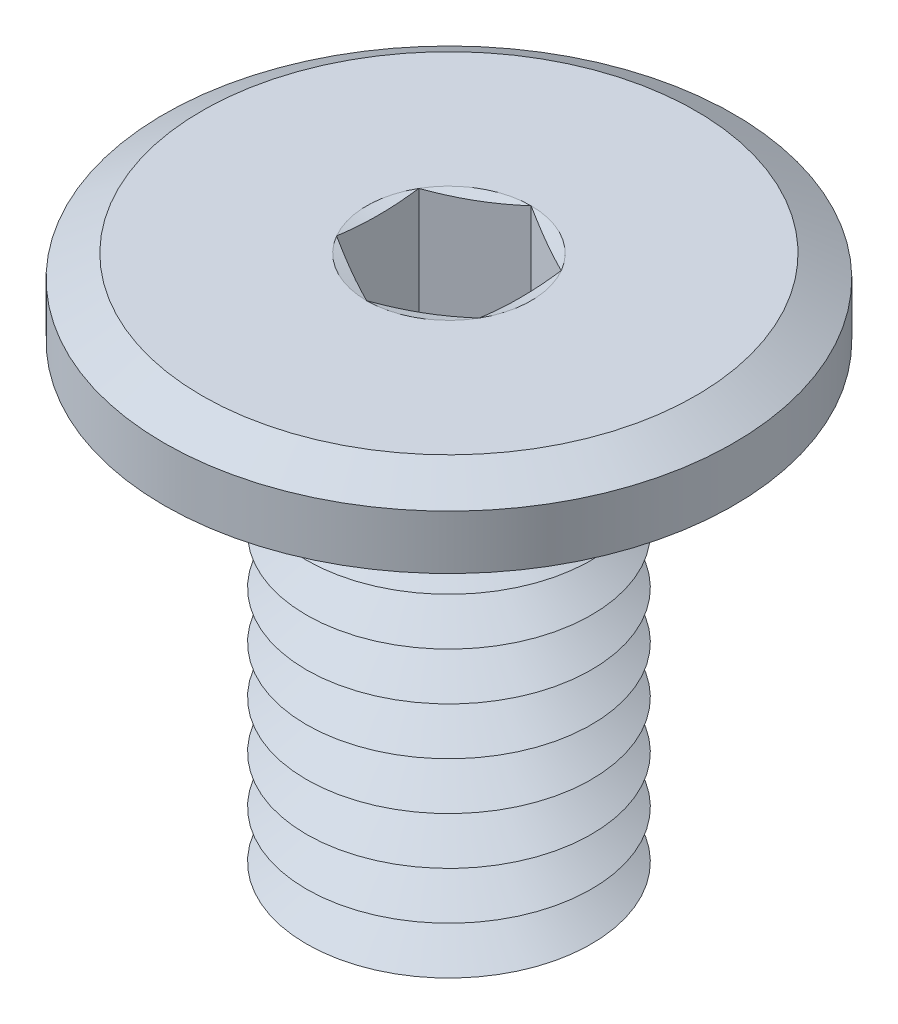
ISO-10303-21;
HEADER;
FILE_DESCRIPTION(('STEP AP214'),'2;1');
FILE_NAME('part.step','',(''),(''),'','','');
FILE_SCHEMA(('AUTOMOTIVE_DESIGN { 1 0 10303 214 1 1 1 1 }'));
ENDSEC;
DATA;
#1=APPLICATION_CONTEXT('core data for automotive mechanical design processes');
#2=APPLICATION_PROTOCOL_DEFINITION('international standard','automotive_design',2000,#1);
#3=PRODUCT_CONTEXT('',#1,'mechanical');
#4=PRODUCT('Part','Part','',(#3));
#5=PRODUCT_RELATED_PRODUCT_CATEGORY('part','',(#4));
#6=PRODUCT_DEFINITION_FORMATION('','',#4);
#7=PRODUCT_DEFINITION_CONTEXT('part definition',#1,'design');
#8=PRODUCT_DEFINITION('design','',#6,#7);
#9=PRODUCT_DEFINITION_SHAPE('','',#8);
#10=(LENGTH_UNIT() NAMED_UNIT(*) SI_UNIT(.MILLI.,.METRE.));
#11=(NAMED_UNIT(*) PLANE_ANGLE_UNIT() SI_UNIT($,.RADIAN.));
#12=(NAMED_UNIT(*) SI_UNIT($,.STERADIAN.) SOLID_ANGLE_UNIT());
#13=UNCERTAINTY_MEASURE_WITH_UNIT(LENGTH_MEASURE(1.E-05),#10,'distance_accuracy_value','');
#14=(GEOMETRIC_REPRESENTATION_CONTEXT(3) GLOBAL_UNCERTAINTY_ASSIGNED_CONTEXT((#13)) GLOBAL_UNIT_ASSIGNED_CONTEXT((#10,
#11,#12)) REPRESENTATION_CONTEXT('',''));
#15=CARTESIAN_POINT('',(0.,0.,0.));
#16=DIRECTION('',(0.,0.,1.));
#17=DIRECTION('',(1.,0.,0.));
#18=AXIS2_PLACEMENT_3D('',#15,#16,#17);
#19=CARTESIAN_POINT('',(0.,-5.05,0.));
#20=DIRECTION('',(0.,-1.,0.));
#21=DIRECTION('',(0.,0.,-1.));
#22=AXIS2_PLACEMENT_3D('',#19,#20,#21);
#23=CONICAL_SURFACE('',#22,1.5,1.0471975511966);
#24=CARTESIAN_POINT('',(0.,-4.8,0.));
#25=DIRECTION('',(0.,1.,0.));
#26=DIRECTION('',(0.,0.,1.));
#27=AXIS2_PLACEMENT_3D('',#24,#25,#26);
#28=CIRCLE('',#27,1.06698729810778);
#29=CARTESIAN_POINT('',(0.,-4.8,1.06698729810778));
#30=VERTEX_POINT('',#29);
#31=EDGE_CURVE('E428',#30,#30,#28,.T.);
#32=ORIENTED_EDGE('',*,*,#31,.F.);
#33=EDGE_LOOP('',(#32));
#34=FACE_BOUND('',#33,.T.);
#35=CARTESIAN_POINT('',(0.,-5.05,0.));
#36=DIRECTION('',(0.,1.,0.));
#37=DIRECTION('',(0.,0.,1.));
#38=AXIS2_PLACEMENT_3D('',#35,#36,#37);
#39=CIRCLE('',#38,1.5);
#40=CARTESIAN_POINT('',(0.,-5.05,1.5));
#41=VERTEX_POINT('',#40);
#42=EDGE_CURVE('E431',#41,#41,#39,.T.);
#43=ORIENTED_EDGE('',*,*,#42,.T.);
#44=EDGE_LOOP('',(#43));
#45=FACE_BOUND('',#44,.T.);
#46=ADVANCED_FACE('F39',(#34,#45),#23,.T.);
#47=CARTESIAN_POINT('',(0.,-4.8,0.));
#48=DIRECTION('',(0.,1.,0.));
#49=DIRECTION('',(0.,0.,1.));
#50=AXIS2_PLACEMENT_3D('',#47,#48,#49);
#51=CONICAL_SURFACE('',#50,1.06698729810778,1.0471975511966);
#52=CARTESIAN_POINT('',(0.,-4.55,0.));
#53=DIRECTION('',(0.,1.,0.));
#54=DIRECTION('',(0.,0.,1.));
#55=AXIS2_PLACEMENT_3D('',#52,#53,#54);
#56=CIRCLE('',#55,1.5);
#57=CARTESIAN_POINT('',(0.,-4.55,1.5));
#58=VERTEX_POINT('',#57);
#59=EDGE_CURVE('E424',#58,#58,#56,.T.);
#60=ORIENTED_EDGE('',*,*,#59,.F.);
#61=EDGE_LOOP('',(#60));
#62=FACE_BOUND('',#61,.T.);
#63=ORIENTED_EDGE('',*,*,#31,.T.);
#64=EDGE_LOOP('',(#63));
#65=FACE_BOUND('',#64,.T.);
#66=ADVANCED_FACE('F233',(#62,#65),#51,.T.);
#67=CARTESIAN_POINT('',(0.,-5.8,0.));
#68=DIRECTION('',(0.,-1.,0.));
#69=DIRECTION('',(0.,0.,-1.));
#70=AXIS2_PLACEMENT_3D('',#67,#68,#69);
#71=PLANE('',#70);
#72=CARTESIAN_POINT('',(0.,-5.8,0.));
#73=DIRECTION('',(0.,1.,0.));
#74=DIRECTION('',(0.,0.,1.));
#75=AXIS2_PLACEMENT_3D('',#72,#73,#74);
#76=CIRCLE('',#75,1.06698729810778);
#77=CARTESIAN_POINT('',(0.,-5.8,1.06698729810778));
#78=VERTEX_POINT('',#77);
#79=EDGE_CURVE('E300',#78,#78,#76,.T.);
#80=ORIENTED_EDGE('',*,*,#79,.F.);
#81=EDGE_LOOP('',(#80));
#82=FACE_BOUND('',#81,.T.);
#83=ADVANCED_FACE('F239',(#82),#71,.T.);
#84=CARTESIAN_POINT('',(0.,-5.8,0.));
#85=DIRECTION('',(0.,1.,0.));
#86=DIRECTION('',(0.,0.,1.));
#87=AXIS2_PLACEMENT_3D('',#84,#85,#86);
#88=CONICAL_SURFACE('',#87,1.06698729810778,1.0471975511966);
#89=CARTESIAN_POINT('',(0.,-5.55,0.));
#90=DIRECTION('',(0.,1.,0.));
#91=DIRECTION('',(0.,0.,1.));
#92=AXIS2_PLACEMENT_3D('',#89,#90,#91);
#93=CIRCLE('',#92,1.5);
#94=CARTESIAN_POINT('',(0.,-5.55,1.5));
#95=VERTEX_POINT('',#94);
#96=EDGE_CURVE('E437',#95,#95,#93,.T.);
#97=ORIENTED_EDGE('',*,*,#96,.F.);
#98=EDGE_LOOP('',(#97));
#99=FACE_BOUND('',#98,.T.);
#100=ORIENTED_EDGE('',*,*,#79,.T.);
#101=EDGE_LOOP('',(#100));
#102=FACE_BOUND('',#101,.T.);
#103=ADVANCED_FACE('F254',(#99,#102),#88,.T.);
#104=CARTESIAN_POINT('',(0.,-5.55,0.));
#105=DIRECTION('',(0.,-1.,0.));
#106=DIRECTION('',(0.,0.,-1.));
#107=AXIS2_PLACEMENT_3D('',#104,#105,#106);
#108=CONICAL_SURFACE('',#107,1.5,1.0471975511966);
#109=CARTESIAN_POINT('',(0.,-5.3,0.));
#110=DIRECTION('',(0.,1.,0.));
#111=DIRECTION('',(0.,0.,1.));
#112=AXIS2_PLACEMENT_3D('',#109,#110,#111);
#113=CIRCLE('',#112,1.06698729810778);
#114=CARTESIAN_POINT('',(0.,-5.3,1.06698729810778));
#115=VERTEX_POINT('',#114);
#116=EDGE_CURVE('E434',#115,#115,#113,.T.);
#117=ORIENTED_EDGE('',*,*,#116,.F.);
#118=EDGE_LOOP('',(#117));
#119=FACE_BOUND('',#118,.T.);
#120=ORIENTED_EDGE('',*,*,#96,.T.);
#121=EDGE_LOOP('',(#120));
#122=FACE_BOUND('',#121,.T.);
#123=ADVANCED_FACE('F250',(#119,#122),#108,.T.);
#124=CARTESIAN_POINT('',(0.,-5.3,0.));
#125=DIRECTION('',(0.,1.,0.));
#126=DIRECTION('',(0.,0.,1.));
#127=AXIS2_PLACEMENT_3D('',#124,#125,#126);
#128=CONICAL_SURFACE('',#127,1.06698729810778,1.0471975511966);
#129=ORIENTED_EDGE('',*,*,#42,.F.);
#130=EDGE_LOOP('',(#129));
#131=FACE_BOUND('',#130,.T.);
#132=ORIENTED_EDGE('',*,*,#116,.T.);
#133=EDGE_LOOP('',(#132));
#134=FACE_BOUND('',#133,.T.);
#135=ADVANCED_FACE('F246',(#131,#134),#128,.T.);
#136=CARTESIAN_POINT('',(0.,-4.55,0.));
#137=DIRECTION('',(0.,-1.,0.));
#138=DIRECTION('',(0.,0.,-1.));
#139=AXIS2_PLACEMENT_3D('',#136,#137,#138);
#140=CONICAL_SURFACE('',#139,1.5,1.0471975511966);
#141=CARTESIAN_POINT('',(0.,-4.3,0.));
#142=DIRECTION('',(0.,1.,0.));
#143=DIRECTION('',(0.,0.,1.));
#144=AXIS2_PLACEMENT_3D('',#141,#142,#143);
#145=CIRCLE('',#144,1.06698729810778);
#146=CARTESIAN_POINT('',(0.,-4.3,1.06698729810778));
#147=VERTEX_POINT('',#146);
#148=EDGE_CURVE('E420',#147,#147,#145,.T.);
#149=ORIENTED_EDGE('',*,*,#148,.F.);
#150=EDGE_LOOP('',(#149));
#151=FACE_BOUND('',#150,.T.);
#152=ORIENTED_EDGE('',*,*,#59,.T.);
#153=EDGE_LOOP('',(#152));
#154=FACE_BOUND('',#153,.T.);
#155=ADVANCED_FACE('F249',(#151,#154),#140,.T.);
#156=CARTESIAN_POINT('',(0.,-4.3,0.));
#157=DIRECTION('',(0.,1.,0.));
#158=DIRECTION('',(0.,0.,1.));
#159=AXIS2_PLACEMENT_3D('',#156,#157,#158);
#160=CONICAL_SURFACE('',#159,1.06698729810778,1.0471975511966);
#161=CARTESIAN_POINT('',(0.,-4.05,0.));
#162=DIRECTION('',(0.,1.,0.));
#163=DIRECTION('',(0.,0.,1.));
#164=AXIS2_PLACEMENT_3D('',#161,#162,#163);
#165=CIRCLE('',#164,1.5);
#166=CARTESIAN_POINT('',(0.,-4.05,1.5));
#167=VERTEX_POINT('',#166);
#168=EDGE_CURVE('E416',#167,#167,#165,.T.);
#169=ORIENTED_EDGE('',*,*,#168,.F.);
#170=EDGE_LOOP('',(#169));
#171=FACE_BOUND('',#170,.T.);
#172=ORIENTED_EDGE('',*,*,#148,.T.);
#173=EDGE_LOOP('',(#172));
#174=FACE_BOUND('',#173,.T.);
#175=ADVANCED_FACE('F536',(#171,#174),#160,.T.);
#176=CARTESIAN_POINT('',(0.,-4.05,0.));
#177=DIRECTION('',(0.,-1.,0.));
#178=DIRECTION('',(0.,0.,-1.));
#179=AXIS2_PLACEMENT_3D('',#176,#177,#178);
#180=CONICAL_SURFACE('',#179,1.5,1.0471975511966);
#181=CARTESIAN_POINT('',(0.,-3.8,0.));
#182=DIRECTION('',(0.,1.,0.));
#183=DIRECTION('',(0.,0.,1.));
#184=AXIS2_PLACEMENT_3D('',#181,#182,#183);
#185=CIRCLE('',#184,1.06698729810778);
#186=CARTESIAN_POINT('',(0.,-3.8,1.06698729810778));
#187=VERTEX_POINT('',#186);
#188=EDGE_CURVE('E413',#187,#187,#185,.T.);
#189=ORIENTED_EDGE('',*,*,#188,.F.);
#190=EDGE_LOOP('',(#189));
#191=FACE_BOUND('',#190,.T.);
#192=ORIENTED_EDGE('',*,*,#168,.T.);
#193=EDGE_LOOP('',(#192));
#194=FACE_BOUND('',#193,.T.);
#195=ADVANCED_FACE('F532',(#191,#194),#180,.T.);
#196=CARTESIAN_POINT('',(0.,-3.8,0.));
#197=DIRECTION('',(0.,1.,0.));
#198=DIRECTION('',(0.,0.,1.));
#199=AXIS2_PLACEMENT_3D('',#196,#197,#198);
#200=CONICAL_SURFACE('',#199,1.06698729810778,1.0471975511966);
#201=CARTESIAN_POINT('',(0.,-3.55,0.));
#202=DIRECTION('',(0.,1.,0.));
#203=DIRECTION('',(0.,0.,1.));
#204=AXIS2_PLACEMENT_3D('',#201,#202,#203);
#205=CIRCLE('',#204,1.5);
#206=CARTESIAN_POINT('',(0.,-3.55,1.5));
#207=VERTEX_POINT('',#206);
#208=EDGE_CURVE('E409',#207,#207,#205,.T.);
#209=ORIENTED_EDGE('',*,*,#208,.F.);
#210=EDGE_LOOP('',(#209));
#211=FACE_BOUND('',#210,.T.);
#212=ORIENTED_EDGE('',*,*,#188,.T.);
#213=EDGE_LOOP('',(#212));
#214=FACE_BOUND('',#213,.T.);
#215=ADVANCED_FACE('F528',(#211,#214),#200,.T.);
#216=CARTESIAN_POINT('',(0.,-3.55,0.));
#217=DIRECTION('',(0.,-1.,0.));
#218=DIRECTION('',(0.,0.,-1.));
#219=AXIS2_PLACEMENT_3D('',#216,#217,#218);
#220=CONICAL_SURFACE('',#219,1.5,1.0471975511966);
#221=CARTESIAN_POINT('',(0.,-3.3,0.));
#222=DIRECTION('',(0.,1.,0.));
#223=DIRECTION('',(0.,0.,1.));
#224=AXIS2_PLACEMENT_3D('',#221,#222,#223);
#225=CIRCLE('',#224,1.06698729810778);
#226=CARTESIAN_POINT('',(0.,-3.3,1.06698729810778));
#227=VERTEX_POINT('',#226);
#228=EDGE_CURVE('E405',#227,#227,#225,.T.);
#229=ORIENTED_EDGE('',*,*,#228,.F.);
#230=EDGE_LOOP('',(#229));
#231=FACE_BOUND('',#230,.T.);
#232=ORIENTED_EDGE('',*,*,#208,.T.);
#233=EDGE_LOOP('',(#232));
#234=FACE_BOUND('',#233,.T.);
#235=ADVANCED_FACE('F524',(#231,#234),#220,.T.);
#236=CARTESIAN_POINT('',(0.,-3.3,0.));
#237=DIRECTION('',(0.,1.,0.));
#238=DIRECTION('',(0.,0.,1.));
#239=AXIS2_PLACEMENT_3D('',#236,#237,#238);
#240=CONICAL_SURFACE('',#239,1.06698729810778,1.0471975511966);
#241=CARTESIAN_POINT('',(0.,-3.05,0.));
#242=DIRECTION('',(0.,1.,0.));
#243=DIRECTION('',(0.,0.,1.));
#244=AXIS2_PLACEMENT_3D('',#241,#242,#243);
#245=CIRCLE('',#244,1.5);
#246=CARTESIAN_POINT('',(0.,-3.05,1.5));
#247=VERTEX_POINT('',#246);
#248=EDGE_CURVE('E401',#247,#247,#245,.T.);
#249=ORIENTED_EDGE('',*,*,#248,.F.);
#250=EDGE_LOOP('',(#249));
#251=FACE_BOUND('',#250,.T.);
#252=ORIENTED_EDGE('',*,*,#228,.T.);
#253=EDGE_LOOP('',(#252));
#254=FACE_BOUND('',#253,.T.);
#255=ADVANCED_FACE('F520',(#251,#254),#240,.T.);
#256=CARTESIAN_POINT('',(0.,-3.05,0.));
#257=DIRECTION('',(0.,-1.,0.));
#258=DIRECTION('',(0.,0.,-1.));
#259=AXIS2_PLACEMENT_3D('',#256,#257,#258);
#260=CONICAL_SURFACE('',#259,1.5,1.0471975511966);
#261=CARTESIAN_POINT('',(0.,-2.8,0.));
#262=DIRECTION('',(0.,1.,0.));
#263=DIRECTION('',(0.,0.,1.));
#264=AXIS2_PLACEMENT_3D('',#261,#262,#263);
#265=CIRCLE('',#264,1.06698729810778);
#266=CARTESIAN_POINT('',(0.,-2.8,1.06698729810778));
#267=VERTEX_POINT('',#266);
#268=EDGE_CURVE('E397',#267,#267,#265,.T.);
#269=ORIENTED_EDGE('',*,*,#268,.F.);
#270=EDGE_LOOP('',(#269));
#271=FACE_BOUND('',#270,.T.);
#272=ORIENTED_EDGE('',*,*,#248,.T.);
#273=EDGE_LOOP('',(#272));
#274=FACE_BOUND('',#273,.T.);
#275=ADVANCED_FACE('F516',(#271,#274),#260,.T.);
#276=CARTESIAN_POINT('',(0.,-2.8,0.));
#277=DIRECTION('',(0.,1.,0.));
#278=DIRECTION('',(0.,0.,1.));
#279=AXIS2_PLACEMENT_3D('',#276,#277,#278);
#280=CONICAL_SURFACE('',#279,1.06698729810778,1.0471975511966);
#281=CARTESIAN_POINT('',(0.,-2.55,0.));
#282=DIRECTION('',(0.,1.,0.));
#283=DIRECTION('',(0.,0.,1.));
#284=AXIS2_PLACEMENT_3D('',#281,#282,#283);
#285=CIRCLE('',#284,1.5);
#286=CARTESIAN_POINT('',(0.,-2.55,1.5));
#287=VERTEX_POINT('',#286);
#288=EDGE_CURVE('E393',#287,#287,#285,.T.);
#289=ORIENTED_EDGE('',*,*,#288,.F.);
#290=EDGE_LOOP('',(#289));
#291=FACE_BOUND('',#290,.T.);
#292=ORIENTED_EDGE('',*,*,#268,.T.);
#293=EDGE_LOOP('',(#292));
#294=FACE_BOUND('',#293,.T.);
#295=ADVANCED_FACE('F512',(#291,#294),#280,.T.);
#296=CARTESIAN_POINT('',(0.,-2.55,0.));
#297=DIRECTION('',(0.,-1.,0.));
#298=DIRECTION('',(0.,0.,-1.));
#299=AXIS2_PLACEMENT_3D('',#296,#297,#298);
#300=CONICAL_SURFACE('',#299,1.5,1.0471975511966);
#301=CARTESIAN_POINT('',(0.,-2.3,0.));
#302=DIRECTION('',(0.,1.,0.));
#303=DIRECTION('',(0.,0.,1.));
#304=AXIS2_PLACEMENT_3D('',#301,#302,#303);
#305=CIRCLE('',#304,1.06698729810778);
#306=CARTESIAN_POINT('',(0.,-2.3,1.06698729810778));
#307=VERTEX_POINT('',#306);
#308=EDGE_CURVE('E389',#307,#307,#305,.T.);
#309=ORIENTED_EDGE('',*,*,#308,.F.);
#310=EDGE_LOOP('',(#309));
#311=FACE_BOUND('',#310,.T.);
#312=ORIENTED_EDGE('',*,*,#288,.T.);
#313=EDGE_LOOP('',(#312));
#314=FACE_BOUND('',#313,.T.);
#315=ADVANCED_FACE('F508',(#311,#314),#300,.T.);
#316=CARTESIAN_POINT('',(0.,-2.3,0.));
#317=DIRECTION('',(0.,1.,0.));
#318=DIRECTION('',(0.,0.,1.));
#319=AXIS2_PLACEMENT_3D('',#316,#317,#318);
#320=CONICAL_SURFACE('',#319,1.06698729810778,1.0471975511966);
#321=CARTESIAN_POINT('',(0.,-2.05,0.));
#322=DIRECTION('',(0.,1.,0.));
#323=DIRECTION('',(0.,0.,1.));
#324=AXIS2_PLACEMENT_3D('',#321,#322,#323);
#325=CIRCLE('',#324,1.5);
#326=CARTESIAN_POINT('',(0.,-2.05,1.5));
#327=VERTEX_POINT('',#326);
#328=EDGE_CURVE('E385',#327,#327,#325,.T.);
#329=ORIENTED_EDGE('',*,*,#328,.F.);
#330=EDGE_LOOP('',(#329));
#331=FACE_BOUND('',#330,.T.);
#332=ORIENTED_EDGE('',*,*,#308,.T.);
#333=EDGE_LOOP('',(#332));
#334=FACE_BOUND('',#333,.T.);
#335=ADVANCED_FACE('F504',(#331,#334),#320,.T.);
#336=CARTESIAN_POINT('',(0.,-2.05,0.));
#337=DIRECTION('',(0.,-1.,0.));
#338=DIRECTION('',(0.,0.,-1.));
#339=AXIS2_PLACEMENT_3D('',#336,#337,#338);
#340=CONICAL_SURFACE('',#339,1.5,1.0471975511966);
#341=CARTESIAN_POINT('',(0.,-1.8,0.));
#342=DIRECTION('',(0.,1.,0.));
#343=DIRECTION('',(0.,0.,1.));
#344=AXIS2_PLACEMENT_3D('',#341,#342,#343);
#345=CIRCLE('',#344,1.06698729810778);
#346=CARTESIAN_POINT('',(0.,-1.8,1.06698729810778));
#347=VERTEX_POINT('',#346);
#348=EDGE_CURVE('E381',#347,#347,#345,.T.);
#349=ORIENTED_EDGE('',*,*,#348,.F.);
#350=EDGE_LOOP('',(#349));
#351=FACE_BOUND('',#350,.T.);
#352=ORIENTED_EDGE('',*,*,#328,.T.);
#353=EDGE_LOOP('',(#352));
#354=FACE_BOUND('',#353,.T.);
#355=ADVANCED_FACE('F500',(#351,#354),#340,.T.);
#356=CARTESIAN_POINT('',(0.,-1.8,0.));
#357=DIRECTION('',(0.,1.,0.));
#358=DIRECTION('',(0.,0.,1.));
#359=AXIS2_PLACEMENT_3D('',#356,#357,#358);
#360=CONICAL_SURFACE('',#359,1.06698729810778,1.0471975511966);
#361=CARTESIAN_POINT('',(0.,-1.55,0.));
#362=DIRECTION('',(0.,1.,0.));
#363=DIRECTION('',(0.,0.,1.));
#364=AXIS2_PLACEMENT_3D('',#361,#362,#363);
#365=CIRCLE('',#364,1.5);
#366=CARTESIAN_POINT('',(0.,-1.55,1.5));
#367=VERTEX_POINT('',#366);
#368=EDGE_CURVE('E367',#367,#367,#365,.T.);
#369=ORIENTED_EDGE('',*,*,#368,.F.);
#370=EDGE_LOOP('',(#369));
#371=FACE_BOUND('',#370,.T.);
#372=ORIENTED_EDGE('',*,*,#348,.T.);
#373=EDGE_LOOP('',(#372));
#374=FACE_BOUND('',#373,.T.);
#375=ADVANCED_FACE('F274',(#371,#374),#360,.T.);
#376=CARTESIAN_POINT('',(0.,0.,0.));
#377=DIRECTION('',(0.,1.,0.));
#378=DIRECTION('',(0.,0.,1.));
#379=AXIS2_PLACEMENT_3D('',#376,#377,#378);
#380=PLANE('',#379);
#381=CARTESIAN_POINT('',(0.,0.,0.));
#382=DIRECTION('',(0.,1.,0.));
#383=DIRECTION('',(0.,0.,1.));
#384=AXIS2_PLACEMENT_3D('',#381,#382,#383);
#385=CIRCLE('',#384,0.866025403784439);
#386=CARTESIAN_POINT('',(0.,0.,0.866025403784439));
#387=VERTEX_POINT('',#386);
#388=CARTESIAN_POINT('',(0.75,0.,0.43301270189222));
#389=VERTEX_POINT('',#388);
#390=EDGE_CURVE('E66',#387,#389,#385,.T.);
#391=ORIENTED_EDGE('',*,*,#390,.F.);
#392=CARTESIAN_POINT('',(-0.75,0.,0.433012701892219));
#393=VERTEX_POINT('',#392);
#394=EDGE_CURVE('E169',#393,#387,#385,.T.);
#395=ORIENTED_EDGE('',*,*,#394,.F.);
#396=CARTESIAN_POINT('',(-0.75,0.,-0.43301270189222));
#397=VERTEX_POINT('',#396);
#398=EDGE_CURVE('E164',#397,#393,#385,.T.);
#399=ORIENTED_EDGE('',*,*,#398,.F.);
#400=CARTESIAN_POINT('',(0.,0.,-0.866025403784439));
#401=VERTEX_POINT('',#400);
#402=EDGE_CURVE('E128',#401,#397,#385,.T.);
#403=ORIENTED_EDGE('',*,*,#402,.F.);
#404=CARTESIAN_POINT('',(0.75,0.,-0.43301270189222));
#405=VERTEX_POINT('',#404);
#406=EDGE_CURVE('E119',#405,#401,#385,.T.);
#407=ORIENTED_EDGE('',*,*,#406,.F.);
#408=EDGE_CURVE('E59',#389,#405,#385,.T.);
#409=ORIENTED_EDGE('',*,*,#408,.F.);
#410=EDGE_LOOP('',(#391,#395,#399,#403,#407,#409));
#411=FACE_BOUND('',#410,.T.);
#412=CARTESIAN_POINT('',(0.,0.,0.));
#413=DIRECTION('',(0.,1.,0.));
#414=DIRECTION('',(0.,0.,1.));
#415=AXIS2_PLACEMENT_3D('',#412,#413,#414);
#416=CIRCLE('',#415,2.6);
#417=CARTESIAN_POINT('',(0.,0.,2.6));
#418=VERTEX_POINT('',#417);
#419=EDGE_CURVE('E296',#418,#418,#416,.T.);
#420=ORIENTED_EDGE('',*,*,#419,.T.);
#421=EDGE_LOOP('',(#420));
#422=FACE_BOUND('',#421,.T.);
#423=ADVANCED_FACE('F160',(#411,#422),#380,.T.);
#424=CARTESIAN_POINT('',(0.,-0.8,0.));
#425=DIRECTION('',(0.,1.,0.));
#426=DIRECTION('',(0.,0.,1.));
#427=AXIS2_PLACEMENT_3D('',#424,#425,#426);
#428=CYLINDRICAL_SURFACE('',#427,3.);
#429=CARTESIAN_POINT('',(0.,-0.230940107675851,0.));
#430=DIRECTION('',(0.,1.,0.));
#431=DIRECTION('',(0.,0.,1.));
#432=AXIS2_PLACEMENT_3D('',#429,#430,#431);
#433=CIRCLE('',#432,3.);
#434=CARTESIAN_POINT('',(0.,-0.230940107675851,3.));
#435=VERTEX_POINT('',#434);
#436=EDGE_CURVE('E307',#435,#435,#433,.F.);
#437=ORIENTED_EDGE('',*,*,#436,.T.);
#438=EDGE_LOOP('',(#437));
#439=FACE_BOUND('',#438,.T.);
#440=CARTESIAN_POINT('',(0.,-0.8,0.));
#441=DIRECTION('',(0.,1.,0.));
#442=DIRECTION('',(0.,0.,1.));
#443=AXIS2_PLACEMENT_3D('',#440,#441,#442);
#444=CIRCLE('',#443,3.);
#445=CARTESIAN_POINT('',(0.,-0.8,3.));
#446=VERTEX_POINT('',#445);
#447=EDGE_CURVE('E291',#446,#446,#444,.T.);
#448=ORIENTED_EDGE('',*,*,#447,.T.);
#449=EDGE_LOOP('',(#448));
#450=FACE_BOUND('',#449,.T.);
#451=ADVANCED_FACE('F270',(#439,#450),#428,.T.);
#452=CARTESIAN_POINT('',(0.,-0.8,0.));
#453=DIRECTION('',(0.,1.,0.));
#454=DIRECTION('',(0.,0.,1.));
#455=AXIS2_PLACEMENT_3D('',#452,#453,#454);
#456=PLANE('',#455);
#457=CARTESIAN_POINT('',(0.,-0.8,0.));
#458=DIRECTION('',(0.,1.,0.));
#459=DIRECTION('',(0.,0.,1.));
#460=AXIS2_PLACEMENT_3D('',#457,#458,#459);
#461=CIRCLE('',#460,1.6);
#462=CARTESIAN_POINT('',(0.,-0.8,1.6));
#463=VERTEX_POINT('',#462);
#464=EDGE_CURVE('E286',#463,#463,#461,.T.);
#465=ORIENTED_EDGE('',*,*,#464,.T.);
#466=EDGE_LOOP('',(#465));
#467=FACE_BOUND('',#466,.T.);
#468=ORIENTED_EDGE('',*,*,#447,.F.);
#469=EDGE_LOOP('',(#468));
#470=FACE_BOUND('',#469,.T.);
#471=ADVANCED_FACE('F266',(#467,#470),#456,.F.);
#472=CARTESIAN_POINT('',(0.,-5.8,0.));
#473=DIRECTION('',(0.,1.,0.));
#474=DIRECTION('',(0.,0.,1.));
#475=AXIS2_PLACEMENT_3D('',#472,#473,#474);
#476=CYLINDRICAL_SURFACE('',#475,1.5);
#477=CARTESIAN_POINT('',(0.,-0.9,0.));
#478=DIRECTION('',(0.,1.,0.));
#479=DIRECTION('',(0.,0.,1.));
#480=AXIS2_PLACEMENT_3D('',#477,#478,#479);
#481=CIRCLE('',#480,1.5);
#482=CARTESIAN_POINT('',(0.,-0.9,1.5));
#483=VERTEX_POINT('',#482);
#484=EDGE_CURVE('E289',#483,#483,#481,.F.);
#485=ORIENTED_EDGE('',*,*,#484,.T.);
#486=EDGE_LOOP('',(#485));
#487=FACE_BOUND('',#486,.T.);
#488=ORIENTED_EDGE('',*,*,#368,.T.);
#489=EDGE_LOOP('',(#488));
#490=FACE_BOUND('',#489,.T.);
#491=ADVANCED_FACE('F262',(#487,#490),#476,.T.);
#492=CARTESIAN_POINT('',(0.,-0.9,0.));
#493=DIRECTION('',(0.,1.,0.));
#494=DIRECTION('',(0.,0.,1.));
#495=AXIS2_PLACEMENT_3D('',#492,#493,#494);
#496=TOROIDAL_SURFACE('',#495,1.6,0.1);
#497=ORIENTED_EDGE('',*,*,#464,.F.);
#498=EDGE_LOOP('',(#497));
#499=FACE_BOUND('',#498,.T.);
#500=ORIENTED_EDGE('',*,*,#484,.F.);
#501=EDGE_LOOP('',(#500));
#502=FACE_BOUND('',#501,.T.);
#503=ADVANCED_FACE('F265',(#499,#502),#496,.F.);
#504=CARTESIAN_POINT('',(0.,0.,0.));
#505=DIRECTION('',(0.,-1.,0.));
#506=DIRECTION('',(0.,0.,-1.));
#507=AXIS2_PLACEMENT_3D('',#504,#505,#506);
#508=CONICAL_SURFACE('',#507,2.6,1.0471975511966);
#509=ORIENTED_EDGE('',*,*,#436,.F.);
#510=EDGE_LOOP('',(#509));
#511=FACE_BOUND('',#510,.T.);
#512=ORIENTED_EDGE('',*,*,#419,.F.);
#513=EDGE_LOOP('',(#512));
#514=FACE_BOUND('',#513,.T.);
#515=ADVANCED_FACE('F41',(#511,#514),#508,.T.);
#516=CARTESIAN_POINT('',(0.,0.,0.));
#517=DIRECTION('',(0.,1.,0.));
#518=DIRECTION('',(0.,0.,1.));
#519=AXIS2_PLACEMENT_3D('',#516,#517,#518);
#520=CONICAL_SURFACE('',#519,0.866025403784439,1.30899693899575);
#521=ORIENTED_EDGE('',*,*,#402,.T.);
#522=CARTESIAN_POINT('',(0.00020000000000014,3.0946294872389E-05,-0.866140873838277));
#523=CARTESIAN_POINT('',(-0.0309621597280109,-0.00479360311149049,-0.84814939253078));
#524=CARTESIAN_POINT('',(-0.0621808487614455,-0.00917362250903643,-0.830125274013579));
#525=CARTESIAN_POINT('',(-0.124728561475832,-0.0168690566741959,-0.794013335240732));
#526=CARTESIAN_POINT('',(-0.156057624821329,-0.0201840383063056,-0.775925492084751));
#527=CARTESIAN_POINT('',(-0.21863598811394,-0.0255557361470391,-0.739795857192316));
#528=CARTESIAN_POINT('',(-0.2498848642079,-0.0276188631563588,-0.721754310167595));
#529=CARTESIAN_POINT('',(-0.312422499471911,-0.0303853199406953,-0.685648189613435));
#530=CARTESIAN_POINT('',(-0.343711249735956,-0.0310889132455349,-0.667583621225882));
#531=CARTESIAN_POINT('',(-0.406288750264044,-0.0310889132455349,-0.631454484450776));
#532=CARTESIAN_POINT('',(-0.437577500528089,-0.0303853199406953,-0.613389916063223));
#533=CARTESIAN_POINT('',(-0.5001151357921,-0.0276188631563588,-0.577283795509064));
#534=CARTESIAN_POINT('',(-0.53136401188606,-0.0255557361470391,-0.559242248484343));
#535=CARTESIAN_POINT('',(-0.593942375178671,-0.0201840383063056,-0.523112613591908));
#536=CARTESIAN_POINT('',(-0.625271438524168,-0.0168690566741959,-0.505024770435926));
#537=CARTESIAN_POINT('',(-0.687819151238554,-0.00917362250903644,-0.46891283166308));
#538=CARTESIAN_POINT('',(-0.719037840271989,-0.0047936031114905,-0.450888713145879));
#539=CARTESIAN_POINT('',(-0.7502,3.09462948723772E-05,-0.432897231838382));
#540=B_SPLINE_CURVE_WITH_KNOTS('',3,(#522,#523,#524,#525,#526,#527,#528,#529,#530,#531,#532,
#533,#534,#535,#536,#537,#538,#539),.UNSPECIFIED.,.F.,.F.,(4,2,2,2,2,2,2,2,4),(0.,
0.108920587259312,0.217885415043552,0.326287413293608,0.434668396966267,0.543049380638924,
0.651451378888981,0.760416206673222,0.869336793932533),.UNSPECIFIED.);
#541=EDGE_CURVE('E11',#401,#397,#540,.T.);
#542=ORIENTED_EDGE('',*,*,#541,.F.);
#543=EDGE_LOOP('',(#521,#542));
#544=FACE_BOUND('',#543,.T.);
#545=ADVANCED_FACE('F132',(#544),#520,.F.);
#546=ORIENTED_EDGE('',*,*,#398,.T.);
#547=CARTESIAN_POINT('',(-0.75,0.177029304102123,-1.32978817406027));
#548=CARTESIAN_POINT('',(-0.75,0.162091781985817,-1.26569678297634));
#549=CARTESIAN_POINT('',(-0.75,0.147363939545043,-1.20155322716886));
#550=CARTESIAN_POINT('',(-0.75,0.118617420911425,-1.07309552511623));
#551=CARTESIAN_POINT('',(-0.75,0.10459887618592,-1.00878134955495));
#552=CARTESIAN_POINT('',(-0.75,0.0774349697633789,-0.879312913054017));
#553=CARTESIAN_POINT('',(-0.75,0.0642994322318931,-0.814156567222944));
#554=CARTESIAN_POINT('',(-0.75,0.0395688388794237,-0.683540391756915));
#555=CARTESIAN_POINT('',(-0.75,0.0279739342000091,-0.618080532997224));
#556=CARTESIAN_POINT('',(-0.75,0.00739697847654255,-0.488585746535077));
#557=CARTESIAN_POINT('',(-0.75,-0.00164814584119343,-0.424561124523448));
#558=CARTESIAN_POINT('',(-0.75,-0.0165441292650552,-0.296144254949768));
#559=CARTESIAN_POINT('',(-0.75,-0.022396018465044,-0.231752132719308));
#560=CARTESIAN_POINT('',(-0.75,-0.0298945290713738,-0.103003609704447));
#561=CARTESIAN_POINT('',(-0.75,-0.0315603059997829,-0.0386483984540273));
#562=CARTESIAN_POINT('',(-0.75,-0.0303818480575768,0.0900234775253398));
#563=CARTESIAN_POINT('',(-0.75,-0.0275372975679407,0.154340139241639));
#564=CARTESIAN_POINT('',(-0.75,-0.0192590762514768,0.264921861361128));
#565=CARTESIAN_POINT('',(-0.75,-0.0147584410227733,0.311262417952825));
#566=CARTESIAN_POINT('',(-0.75,-0.00409265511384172,0.403747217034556));
#567=CARTESIAN_POINT('',(-0.75,0.00207245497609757,0.449891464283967));
#568=CARTESIAN_POINT('',(-0.75,0.0225208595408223,0.588341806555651));
#569=CARTESIAN_POINT('',(-0.75,0.0387292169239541,0.680359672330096));
#570=CARTESIAN_POINT('',(-0.75,0.06537279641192,0.818919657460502));
#571=CARTESIAN_POINT('',(-0.75,0.0747513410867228,0.865678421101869));
#572=CARTESIAN_POINT('',(-0.75,0.0940825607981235,0.959079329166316));
#573=CARTESIAN_POINT('',(-0.75,0.104035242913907,1.00572147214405));
#574=CARTESIAN_POINT('',(-0.75,0.124311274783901,1.09864456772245));
#575=CARTESIAN_POINT('',(-0.75,0.134632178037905,1.14492606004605));
#576=CARTESIAN_POINT('',(-0.75,0.155605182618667,1.23741055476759));
#577=CARTESIAN_POINT('',(-0.75,0.166257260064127,1.28361356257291));
#578=CARTESIAN_POINT('',(-0.75,0.177029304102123,1.32978817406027));
#579=B_SPLINE_CURVE_WITH_KNOTS('',3,(#547,#548,#549,#550,#551,#552,#553,#554,#555,#556,#557,
#558,#559,#560,#561,#562,#563,#564,#565,#566,#567,#568,#569,#570,#571,#572,#573,#574,#575,#576,
#577,#578),.UNSPECIFIED.,.F.,.F.,(4,2,2,2,2,2,2,2,2,2,2,2,2,2,2,4),(0.,0.197431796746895,
0.394900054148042,0.594289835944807,0.793699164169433,0.987625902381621,1.18149004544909,
1.37446544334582,1.56745434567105,1.7070970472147,1.84673634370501,2.12693471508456,
2.27000544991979,2.41307794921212,2.55533188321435,2.69757558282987),.UNSPECIFIED.);
#580=EDGE_CURVE('E172',#397,#393,#579,.T.);
#581=ORIENTED_EDGE('',*,*,#580,.F.);
#582=EDGE_LOOP('',(#546,#581));
#583=FACE_BOUND('',#582,.T.);
#584=ADVANCED_FACE('F612',(#583),#520,.F.);
#585=ORIENTED_EDGE('',*,*,#394,.T.);
#586=CARTESIAN_POINT('',(-0.7502,3.09462948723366E-05,0.432897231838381));
#587=CARTESIAN_POINT('',(-0.719037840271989,-0.00479360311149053,0.450888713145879));
#588=CARTESIAN_POINT('',(-0.687819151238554,-0.00917362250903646,0.468912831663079));
#589=CARTESIAN_POINT('',(-0.625271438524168,-0.0168690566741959,0.505024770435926));
#590=CARTESIAN_POINT('',(-0.593942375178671,-0.0201840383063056,0.523112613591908));
#591=CARTESIAN_POINT('',(-0.53136401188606,-0.0255557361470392,0.559242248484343));
#592=CARTESIAN_POINT('',(-0.5001151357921,-0.0276188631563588,0.577283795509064));
#593=CARTESIAN_POINT('',(-0.437577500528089,-0.0303853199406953,0.613389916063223));
#594=CARTESIAN_POINT('',(-0.406288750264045,-0.0310889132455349,0.631454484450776));
#595=CARTESIAN_POINT('',(-0.343711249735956,-0.0310889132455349,0.667583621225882));
#596=CARTESIAN_POINT('',(-0.312422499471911,-0.0303853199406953,0.685648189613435));
#597=CARTESIAN_POINT('',(-0.2498848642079,-0.0276188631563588,0.721754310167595));
#598=CARTESIAN_POINT('',(-0.21863598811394,-0.0255557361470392,0.739795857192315));
#599=CARTESIAN_POINT('',(-0.15605762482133,-0.0201840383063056,0.775925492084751));
#600=CARTESIAN_POINT('',(-0.124728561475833,-0.0168690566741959,0.794013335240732));
#601=CARTESIAN_POINT('',(-0.0621808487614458,-0.00917362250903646,0.830125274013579));
#602=CARTESIAN_POINT('',(-0.0309621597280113,-0.00479360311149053,0.848149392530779));
#603=CARTESIAN_POINT('',(0.000199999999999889,3.0946294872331E-05,0.866140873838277));
#604=B_SPLINE_CURVE_WITH_KNOTS('',3,(#586,#587,#588,#589,#590,#591,#592,#593,#594,#595,#596,
#597,#598,#599,#600,#601,#602,#603),.UNSPECIFIED.,.F.,.F.,(4,2,2,2,2,2,2,2,4),(0.,
0.108920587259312,0.217885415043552,0.326287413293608,0.434668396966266,0.543049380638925,
0.651451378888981,0.760416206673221,0.869336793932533),.UNSPECIFIED.);
#605=EDGE_CURVE('E180',#393,#387,#604,.T.);
#606=ORIENTED_EDGE('',*,*,#605,.F.);
#607=EDGE_LOOP('',(#585,#606));
#608=FACE_BOUND('',#607,.T.);
#609=ADVANCED_FACE('F619',(#608),#520,.F.);
#610=ORIENTED_EDGE('',*,*,#390,.T.);
#611=CARTESIAN_POINT('',(-0.000200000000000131,3.09462948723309E-05,0.866140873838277));
#612=CARTESIAN_POINT('',(0.0309621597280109,-0.00479360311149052,0.848149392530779));
#613=CARTESIAN_POINT('',(0.0621808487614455,-0.00917362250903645,0.830125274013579));
#614=CARTESIAN_POINT('',(0.124728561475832,-0.0168690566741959,0.794013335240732));
#615=CARTESIAN_POINT('',(0.156057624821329,-0.0201840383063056,0.775925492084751));
#616=CARTESIAN_POINT('',(0.21863598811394,-0.0255557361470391,0.739795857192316));
#617=CARTESIAN_POINT('',(0.2498848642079,-0.0276188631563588,0.721754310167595));
#618=CARTESIAN_POINT('',(0.312422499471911,-0.0303853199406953,0.685648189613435));
#619=CARTESIAN_POINT('',(0.343711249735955,-0.0310889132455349,0.667583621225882));
#620=CARTESIAN_POINT('',(0.406288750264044,-0.0310889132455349,0.631454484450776));
#621=CARTESIAN_POINT('',(0.437577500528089,-0.0303853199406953,0.613389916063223));
#622=CARTESIAN_POINT('',(0.5001151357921,-0.0276188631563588,0.577283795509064));
#623=CARTESIAN_POINT('',(0.531364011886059,-0.0255557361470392,0.559242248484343));
#624=CARTESIAN_POINT('',(0.59394237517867,-0.0201840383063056,0.523112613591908));
#625=CARTESIAN_POINT('',(0.625271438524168,-0.0168690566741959,0.505024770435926));
#626=CARTESIAN_POINT('',(0.687819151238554,-0.00917362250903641,0.46891283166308));
#627=CARTESIAN_POINT('',(0.719037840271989,-0.00479360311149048,0.450888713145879));
#628=CARTESIAN_POINT('',(0.7502,3.09462948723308E-05,0.432897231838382));
#629=B_SPLINE_CURVE_WITH_KNOTS('',3,(#611,#612,#613,#614,#615,#616,#617,#618,#619,#620,#621,
#622,#623,#624,#625,#626,#627,#628),.UNSPECIFIED.,.F.,.F.,(4,2,2,2,2,2,2,2,4),(0.,
0.108920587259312,0.217885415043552,0.326287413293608,0.434668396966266,0.543049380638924,
0.651451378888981,0.760416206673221,0.869336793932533),.UNSPECIFIED.);
#630=EDGE_CURVE('E199',#387,#389,#629,.T.);
#631=ORIENTED_EDGE('',*,*,#630,.F.);
#632=EDGE_LOOP('',(#610,#631));
#633=FACE_BOUND('',#632,.T.);
#634=ADVANCED_FACE('F627',(#633),#520,.F.);
#635=ORIENTED_EDGE('',*,*,#408,.T.);
#636=CARTESIAN_POINT('',(0.75,0.177029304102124,1.32978817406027));
#637=CARTESIAN_POINT('',(0.75,0.162091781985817,1.26569678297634));
#638=CARTESIAN_POINT('',(0.75,0.147363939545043,1.20155322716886));
#639=CARTESIAN_POINT('',(0.75,0.118617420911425,1.07309552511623));
#640=CARTESIAN_POINT('',(0.75,0.10459887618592,1.00878134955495));
#641=CARTESIAN_POINT('',(0.75,0.077434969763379,0.879312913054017));
#642=CARTESIAN_POINT('',(0.75,0.0642994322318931,0.814156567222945));
#643=CARTESIAN_POINT('',(0.75,0.0395688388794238,0.683540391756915));
#644=CARTESIAN_POINT('',(0.75,0.0279739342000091,0.618080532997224));
#645=CARTESIAN_POINT('',(0.75,0.00739697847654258,0.488585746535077));
#646=CARTESIAN_POINT('',(0.75,-0.00164814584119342,0.424561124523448));
#647=CARTESIAN_POINT('',(0.75,-0.0165441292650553,0.296144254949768));
#648=CARTESIAN_POINT('',(0.75,-0.022396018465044,0.231752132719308));
#649=CARTESIAN_POINT('',(0.75,-0.0298945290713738,0.103003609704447));
#650=CARTESIAN_POINT('',(0.75,-0.0315603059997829,0.0386483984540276));
#651=CARTESIAN_POINT('',(0.75,-0.0303818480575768,-0.0900234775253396));
#652=CARTESIAN_POINT('',(0.75,-0.0275372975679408,-0.154340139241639));
#653=CARTESIAN_POINT('',(0.75,-0.0192590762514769,-0.264921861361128));
#654=CARTESIAN_POINT('',(0.75,-0.0147584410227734,-0.311262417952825));
#655=CARTESIAN_POINT('',(0.75,-0.00409265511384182,-0.403747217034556));
#656=CARTESIAN_POINT('',(0.75,0.00207245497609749,-0.449891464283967));
#657=CARTESIAN_POINT('',(0.75,0.0225208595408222,-0.588341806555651));
#658=CARTESIAN_POINT('',(0.75,0.038729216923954,-0.680359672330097));
#659=CARTESIAN_POINT('',(0.75,0.06537279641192,-0.818919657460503));
#660=CARTESIAN_POINT('',(0.75,0.0747513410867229,-0.86567842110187));
#661=CARTESIAN_POINT('',(0.75,0.0940825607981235,-0.959079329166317));
#662=CARTESIAN_POINT('',(0.75,0.104035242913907,-1.00572147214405));
#663=CARTESIAN_POINT('',(0.75,0.124311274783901,-1.09864456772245));
#664=CARTESIAN_POINT('',(0.75,0.134632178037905,-1.14492606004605));
#665=CARTESIAN_POINT('',(0.75,0.155605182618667,-1.23741055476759));
#666=CARTESIAN_POINT('',(0.75,0.166257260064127,-1.28361356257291));
#667=CARTESIAN_POINT('',(0.75,0.177029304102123,-1.32978817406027));
#668=B_SPLINE_CURVE_WITH_KNOTS('',3,(#636,#637,#638,#639,#640,#641,#642,#643,#644,#645,#646,
#647,#648,#649,#650,#651,#652,#653,#654,#655,#656,#657,#658,#659,#660,#661,#662,#663,#664,#665,
#666,#667),.UNSPECIFIED.,.F.,.F.,(4,2,2,2,2,2,2,2,2,2,2,2,2,2,2,4),(0.,0.197431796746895,
0.394900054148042,0.594289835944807,0.793699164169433,0.987625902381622,1.18149004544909,
1.37446544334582,1.56745434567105,1.7070970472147,1.84673634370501,2.12693471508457,
2.2700054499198,2.41307794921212,2.55533188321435,2.69757558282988),.UNSPECIFIED.);
#669=EDGE_CURVE('E149',#389,#405,#668,.T.);
#670=ORIENTED_EDGE('',*,*,#669,.F.);
#671=EDGE_LOOP('',(#635,#670));
#672=FACE_BOUND('',#671,.T.);
#673=ADVANCED_FACE('F192',(#672),#520,.F.);
#674=ORIENTED_EDGE('',*,*,#406,.T.);
#675=CARTESIAN_POINT('',(0.7502,3.09462948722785E-05,-0.432897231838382));
#676=CARTESIAN_POINT('',(0.719037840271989,-0.00479360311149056,-0.450888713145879));
#677=CARTESIAN_POINT('',(0.687819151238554,-0.00917362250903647,-0.46891283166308));
#678=CARTESIAN_POINT('',(0.625271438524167,-0.0168690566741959,-0.505024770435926));
#679=CARTESIAN_POINT('',(0.59394237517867,-0.0201840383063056,-0.523112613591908));
#680=CARTESIAN_POINT('',(0.53136401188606,-0.0255557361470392,-0.559242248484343));
#681=CARTESIAN_POINT('',(0.5001151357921,-0.0276188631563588,-0.577283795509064));
#682=CARTESIAN_POINT('',(0.437577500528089,-0.0303853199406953,-0.613389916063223));
#683=CARTESIAN_POINT('',(0.406288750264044,-0.0310889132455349,-0.631454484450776));
#684=CARTESIAN_POINT('',(0.343711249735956,-0.0310889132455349,-0.667583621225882));
#685=CARTESIAN_POINT('',(0.312422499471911,-0.0303853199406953,-0.685648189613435));
#686=CARTESIAN_POINT('',(0.2498848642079,-0.0276188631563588,-0.721754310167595));
#687=CARTESIAN_POINT('',(0.218635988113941,-0.0255557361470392,-0.739795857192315));
#688=CARTESIAN_POINT('',(0.15605762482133,-0.0201840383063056,-0.775925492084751));
#689=CARTESIAN_POINT('',(0.124728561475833,-0.0168690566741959,-0.794013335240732));
#690=CARTESIAN_POINT('',(0.0621808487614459,-0.00917362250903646,-0.830125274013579));
#691=CARTESIAN_POINT('',(0.0309621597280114,-0.00479360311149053,-0.848149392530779));
#692=CARTESIAN_POINT('',(-0.000199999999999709,3.09462948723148E-05,-0.866140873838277));
#693=B_SPLINE_CURVE_WITH_KNOTS('',3,(#675,#676,#677,#678,#679,#680,#681,#682,#683,#684,#685,
#686,#687,#688,#689,#690,#691,#692),.UNSPECIFIED.,.F.,.F.,(4,2,2,2,2,2,2,2,4),(0.,
0.108920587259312,0.217885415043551,0.326287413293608,0.434668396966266,0.543049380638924,
0.651451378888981,0.760416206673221,0.869336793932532),.UNSPECIFIED.);
#694=EDGE_CURVE('E123',#405,#401,#693,.T.);
#695=ORIENTED_EDGE('',*,*,#694,.F.);
#696=EDGE_LOOP('',(#674,#695));
#697=FACE_BOUND('',#696,.T.);
#698=ADVANCED_FACE('F121',(#697),#520,.F.);
#699=CARTESIAN_POINT('',(0.,-1.4,0.));
#700=DIRECTION('',(0.,1.,0.));
#701=DIRECTION('',(0.,0.,1.));
#702=AXIS2_PLACEMENT_3D('',#699,#700,#701);
#703=CONICAL_SURFACE('',#702,0.75,1.0471975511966);
#704=CARTESIAN_POINT('',(0.,-1.83301270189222,0.));
#705=VERTEX_POINT('',#704);
#706=VERTEX_LOOP('',#705);
#707=FACE_BOUND('',#706,.T.);
#708=CARTESIAN_POINT('',(0.,-1.4,0.));
#709=DIRECTION('',(0.,1.,0.));
#710=DIRECTION('',(0.,0.,1.));
#711=AXIS2_PLACEMENT_3D('',#708,#709,#710);
#712=CIRCLE('',#711,0.75);
#713=CARTESIAN_POINT('',(0.375,-1.4,0.649519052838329));
#714=VERTEX_POINT('',#713);
#715=CARTESIAN_POINT('',(0.75,-1.4,0.));
#716=VERTEX_POINT('',#715);
#717=EDGE_CURVE('E148',#714,#716,#712,.T.);
#718=ORIENTED_EDGE('',*,*,#717,.T.);
#719=CARTESIAN_POINT('',(0.,-1.4,0.));
#720=DIRECTION('',(0.,1.,0.));
#721=DIRECTION('',(0.,0.,1.));
#722=AXIS2_PLACEMENT_3D('',#719,#720,#721);
#723=CIRCLE('',#722,0.75);
#724=CARTESIAN_POINT('',(0.375,-1.4,-0.649519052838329));
#725=VERTEX_POINT('',#724);
#726=EDGE_CURVE('E53',#716,#725,#723,.T.);
#727=ORIENTED_EDGE('',*,*,#726,.T.);
#728=CARTESIAN_POINT('',(-0.375,-1.4,-0.649519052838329));
#729=VERTEX_POINT('',#728);
#730=EDGE_CURVE('E319',#725,#729,#723,.T.);
#731=ORIENTED_EDGE('',*,*,#730,.T.);
#732=CARTESIAN_POINT('',(-0.75,-1.4,0.));
#733=VERTEX_POINT('',#732);
#734=EDGE_CURVE('E318',#729,#733,#723,.T.);
#735=ORIENTED_EDGE('',*,*,#734,.T.);
#736=CARTESIAN_POINT('',(-0.375,-1.4,0.649519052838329));
#737=VERTEX_POINT('',#736);
#738=EDGE_CURVE('E312',#733,#737,#723,.T.);
#739=ORIENTED_EDGE('',*,*,#738,.T.);
#740=EDGE_CURVE('E310',#737,#714,#723,.T.);
#741=ORIENTED_EDGE('',*,*,#740,.T.);
#742=EDGE_LOOP('',(#718,#727,#731,#735,#739,#741));
#743=FACE_BOUND('',#742,.T.);
#744=ADVANCED_FACE('F191',(#707,#743),#703,.F.);
#745=CARTESIAN_POINT('',(0.,-1.4,0.));
#746=DIRECTION('',(0.,1.,0.));
#747=DIRECTION('',(0.,0.,1.));
#748=AXIS2_PLACEMENT_3D('',#745,#746,#747);
#749=PLANE('',#748);
#750=ORIENTED_EDGE('',*,*,#726,.F.);
#751=DIRECTION('',(0.,0.,-1.));
#752=VECTOR('',#751,1.);
#753=CARTESIAN_POINT('',(0.75,-1.4,0.43301270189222));
#754=LINE('',#753,#752);
#755=CARTESIAN_POINT('',(0.75,-1.4,-0.43301270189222));
#756=VERTEX_POINT('',#755);
#757=EDGE_CURVE('E361',#716,#756,#754,.T.);
#758=ORIENTED_EDGE('',*,*,#757,.T.);
#759=DIRECTION('',(-0.866025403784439,0.,-0.5));
#760=VECTOR('',#759,1.);
#761=CARTESIAN_POINT('',(0.75,-1.4,-0.43301270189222));
#762=LINE('',#761,#760);
#763=EDGE_CURVE('E444',#756,#725,#762,.T.);
#764=ORIENTED_EDGE('',*,*,#763,.T.);
#765=EDGE_LOOP('',(#750,#758,#764));
#766=FACE_BOUND('',#765,.T.);
#767=ADVANCED_FACE('F456',(#766),#749,.T.);
#768=ORIENTED_EDGE('',*,*,#717,.F.);
#769=DIRECTION('',(0.866025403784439,0.,-0.5));
#770=VECTOR('',#769,1.);
#771=CARTESIAN_POINT('',(0.,-1.4,0.866025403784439));
#772=LINE('',#771,#770);
#773=CARTESIAN_POINT('',(0.75,-1.4,0.43301270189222));
#774=VERTEX_POINT('',#773);
#775=EDGE_CURVE('E356',#714,#774,#772,.T.);
#776=ORIENTED_EDGE('',*,*,#775,.T.);
#777=EDGE_CURVE('E157',#774,#716,#754,.T.);
#778=ORIENTED_EDGE('',*,*,#777,.T.);
#779=EDGE_LOOP('',(#768,#776,#778));
#780=FACE_BOUND('',#779,.T.);
#781=ADVANCED_FACE('F459',(#780),#749,.T.);
#782=ORIENTED_EDGE('',*,*,#740,.F.);
#783=DIRECTION('',(0.866025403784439,0.,0.5));
#784=VECTOR('',#783,1.);
#785=CARTESIAN_POINT('',(-0.75,-1.4,0.433012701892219));
#786=LINE('',#785,#784);
#787=CARTESIAN_POINT('',(0.,-1.4,0.866025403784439));
#788=VERTEX_POINT('',#787);
#789=EDGE_CURVE('E348',#737,#788,#786,.T.);
#790=ORIENTED_EDGE('',*,*,#789,.T.);
#791=EDGE_CURVE('E357',#788,#714,#772,.T.);
#792=ORIENTED_EDGE('',*,*,#791,.T.);
#793=EDGE_LOOP('',(#782,#790,#792));
#794=FACE_BOUND('',#793,.T.);
#795=ADVANCED_FACE('F220',(#794),#749,.T.);
#796=ORIENTED_EDGE('',*,*,#738,.F.);
#797=DIRECTION('',(0.,0.,1.));
#798=VECTOR('',#797,1.);
#799=CARTESIAN_POINT('',(-0.75,-1.4,-0.43301270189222));
#800=LINE('',#799,#798);
#801=CARTESIAN_POINT('',(-0.75,-1.4,0.433012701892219));
#802=VERTEX_POINT('',#801);
#803=EDGE_CURVE('E336',#733,#802,#800,.T.);
#804=ORIENTED_EDGE('',*,*,#803,.T.);
#805=EDGE_CURVE('E339',#802,#737,#786,.T.);
#806=ORIENTED_EDGE('',*,*,#805,.T.);
#807=EDGE_LOOP('',(#796,#804,#806));
#808=FACE_BOUND('',#807,.T.);
#809=ADVANCED_FACE('F335',(#808),#749,.T.);
#810=ORIENTED_EDGE('',*,*,#730,.F.);
#811=CARTESIAN_POINT('',(0.,-1.4,-0.866025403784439));
#812=VERTEX_POINT('',#811);
#813=EDGE_CURVE('E447',#725,#812,#762,.T.);
#814=ORIENTED_EDGE('',*,*,#813,.T.);
#815=DIRECTION('',(-0.866025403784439,0.,0.5));
#816=VECTOR('',#815,1.);
#817=CARTESIAN_POINT('',(0.,-1.4,-0.866025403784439));
#818=LINE('',#817,#816);
#819=EDGE_CURVE('E154',#812,#729,#818,.T.);
#820=ORIENTED_EDGE('',*,*,#819,.T.);
#821=EDGE_LOOP('',(#810,#814,#820));
#822=FACE_BOUND('',#821,.T.);
#823=ADVANCED_FACE('F450',(#822),#749,.T.);
#824=ORIENTED_EDGE('',*,*,#734,.F.);
#825=CARTESIAN_POINT('',(-0.75,-1.4,-0.43301270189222));
#826=VERTEX_POINT('',#825);
#827=EDGE_CURVE('E346',#729,#826,#818,.T.);
#828=ORIENTED_EDGE('',*,*,#827,.T.);
#829=EDGE_CURVE('E341',#826,#733,#800,.T.);
#830=ORIENTED_EDGE('',*,*,#829,.T.);
#831=EDGE_LOOP('',(#824,#828,#830));
#832=FACE_BOUND('',#831,.T.);
#833=ADVANCED_FACE('F345',(#832),#749,.T.);
#834=CARTESIAN_POINT('',(0.,-1.4,-0.866025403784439));
#835=DIRECTION('',(-0.5,0.,-0.866025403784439));
#836=DIRECTION('',(-0.866025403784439,0.,0.5));
#837=AXIS2_PLACEMENT_3D('',#834,#835,#836);
#838=PLANE('',#837);
#839=DIRECTION('',(0.,1.,0.));
#840=VECTOR('',#839,1.);
#841=CARTESIAN_POINT('',(0.,-1.4,-0.866025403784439));
#842=LINE('',#841,#840);
#843=EDGE_CURVE('E142',#812,#401,#842,.T.);
#844=ORIENTED_EDGE('',*,*,#843,.T.);
#845=ORIENTED_EDGE('',*,*,#541,.T.);
#846=DIRECTION('',(0.,1.,0.));
#847=VECTOR('',#846,1.);
#848=CARTESIAN_POINT('',(-0.75,-1.4,-0.43301270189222));
#849=LINE('',#848,#847);
#850=EDGE_CURVE('E156',#826,#397,#849,.T.);
#851=ORIENTED_EDGE('',*,*,#850,.F.);
#852=ORIENTED_EDGE('',*,*,#827,.F.);
#853=ORIENTED_EDGE('',*,*,#819,.F.);
#854=EDGE_LOOP('',(#844,#845,#851,#852,#853));
#855=FACE_BOUND('',#854,.T.);
#856=ADVANCED_FACE('F151',(#855),#838,.F.);
#857=CARTESIAN_POINT('',(-0.75,-1.4,-0.43301270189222));
#858=DIRECTION('',(-1.,0.,0.));
#859=DIRECTION('',(0.,0.,1.));
#860=AXIS2_PLACEMENT_3D('',#857,#858,#859);
#861=PLANE('',#860);
#862=ORIENTED_EDGE('',*,*,#850,.T.);
#863=ORIENTED_EDGE('',*,*,#580,.T.);
#864=DIRECTION('',(0.,1.,0.));
#865=VECTOR('',#864,1.);
#866=CARTESIAN_POINT('',(-0.75,-1.4,0.433012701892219));
#867=LINE('',#866,#865);
#868=EDGE_CURVE('E342',#802,#393,#867,.T.);
#869=ORIENTED_EDGE('',*,*,#868,.F.);
#870=ORIENTED_EDGE('',*,*,#803,.F.);
#871=ORIENTED_EDGE('',*,*,#829,.F.);
#872=EDGE_LOOP('',(#862,#863,#869,#870,#871));
#873=FACE_BOUND('',#872,.T.);
#874=ADVANCED_FACE('F186',(#873),#861,.F.);
#875=CARTESIAN_POINT('',(-0.75,-1.4,0.433012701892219));
#876=DIRECTION('',(-0.5,0.,0.866025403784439));
#877=DIRECTION('',(0.866025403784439,0.,0.5));
#878=AXIS2_PLACEMENT_3D('',#875,#876,#877);
#879=PLANE('',#878);
#880=ORIENTED_EDGE('',*,*,#868,.T.);
#881=ORIENTED_EDGE('',*,*,#605,.T.);
#882=DIRECTION('',(0.,1.,0.));
#883=VECTOR('',#882,1.);
#884=CARTESIAN_POINT('',(0.,-1.4,0.866025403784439));
#885=LINE('',#884,#883);
#886=EDGE_CURVE('E371',#788,#387,#885,.T.);
#887=ORIENTED_EDGE('',*,*,#886,.F.);
#888=ORIENTED_EDGE('',*,*,#789,.F.);
#889=ORIENTED_EDGE('',*,*,#805,.F.);
#890=EDGE_LOOP('',(#880,#881,#887,#888,#889));
#891=FACE_BOUND('',#890,.T.);
#892=ADVANCED_FACE('F223',(#891),#879,.F.);
#893=CARTESIAN_POINT('',(0.,-1.4,0.866025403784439));
#894=DIRECTION('',(0.5,0.,0.866025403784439));
#895=DIRECTION('',(0.866025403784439,0.,-0.5));
#896=AXIS2_PLACEMENT_3D('',#893,#894,#895);
#897=PLANE('',#896);
#898=ORIENTED_EDGE('',*,*,#886,.T.);
#899=ORIENTED_EDGE('',*,*,#630,.T.);
#900=DIRECTION('',(0.,1.,0.));
#901=VECTOR('',#900,1.);
#902=CARTESIAN_POINT('',(0.75,-1.4,0.43301270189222));
#903=LINE('',#902,#901);
#904=EDGE_CURVE('E368',#774,#389,#903,.T.);
#905=ORIENTED_EDGE('',*,*,#904,.F.);
#906=ORIENTED_EDGE('',*,*,#775,.F.);
#907=ORIENTED_EDGE('',*,*,#791,.F.);
#908=EDGE_LOOP('',(#898,#899,#905,#906,#907));
#909=FACE_BOUND('',#908,.T.);
#910=ADVANCED_FACE('F218',(#909),#897,.F.);
#911=CARTESIAN_POINT('',(0.75,-1.4,0.43301270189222));
#912=DIRECTION('',(1.,0.,0.));
#913=DIRECTION('',(0.,0.,-1.));
#914=AXIS2_PLACEMENT_3D('',#911,#912,#913);
#915=PLANE('',#914);
#916=ORIENTED_EDGE('',*,*,#904,.T.);
#917=ORIENTED_EDGE('',*,*,#669,.T.);
#918=DIRECTION('',(0.,1.,0.));
#919=VECTOR('',#918,1.);
#920=CARTESIAN_POINT('',(0.75,-1.4,-0.43301270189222));
#921=LINE('',#920,#919);
#922=EDGE_CURVE('E146',#756,#405,#921,.T.);
#923=ORIENTED_EDGE('',*,*,#922,.F.);
#924=ORIENTED_EDGE('',*,*,#757,.F.);
#925=ORIENTED_EDGE('',*,*,#777,.F.);
#926=EDGE_LOOP('',(#916,#917,#923,#924,#925));
#927=FACE_BOUND('',#926,.T.);
#928=ADVANCED_FACE('F215',(#927),#915,.F.);
#929=CARTESIAN_POINT('',(0.75,-1.4,-0.43301270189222));
#930=DIRECTION('',(0.5,0.,-0.866025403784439));
#931=DIRECTION('',(-0.866025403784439,0.,-0.5));
#932=AXIS2_PLACEMENT_3D('',#929,#930,#931);
#933=PLANE('',#932);
#934=ORIENTED_EDGE('',*,*,#922,.T.);
#935=ORIENTED_EDGE('',*,*,#694,.T.);
#936=ORIENTED_EDGE('',*,*,#843,.F.);
#937=ORIENTED_EDGE('',*,*,#813,.F.);
#938=ORIENTED_EDGE('',*,*,#763,.F.);
#939=EDGE_LOOP('',(#934,#935,#936,#937,#938));
#940=FACE_BOUND('',#939,.T.);
#941=ADVANCED_FACE('F140',(#940),#933,.F.);
#942=CLOSED_SHELL('',(#46,#66,#83,#103,#123,#135,#155,#175,#195,#215,#235,#255,#275,#295,#315,
#335,#355,#375,#423,#451,#471,#491,#503,#515,#545,#584,#609,#634,#673,#698,#744,#767,#781,#795,
#809,#823,#833,#856,#874,#892,#910,#928,#941));
#943=MANIFOLD_SOLID_BREP('B2',#942);
#944=ADVANCED_BREP_SHAPE_REPRESENTATION('',(#18,#943),#14);
#945=SHAPE_DEFINITION_REPRESENTATION(#9,#944);
ENDSEC;
END-ISO-10303-21;
